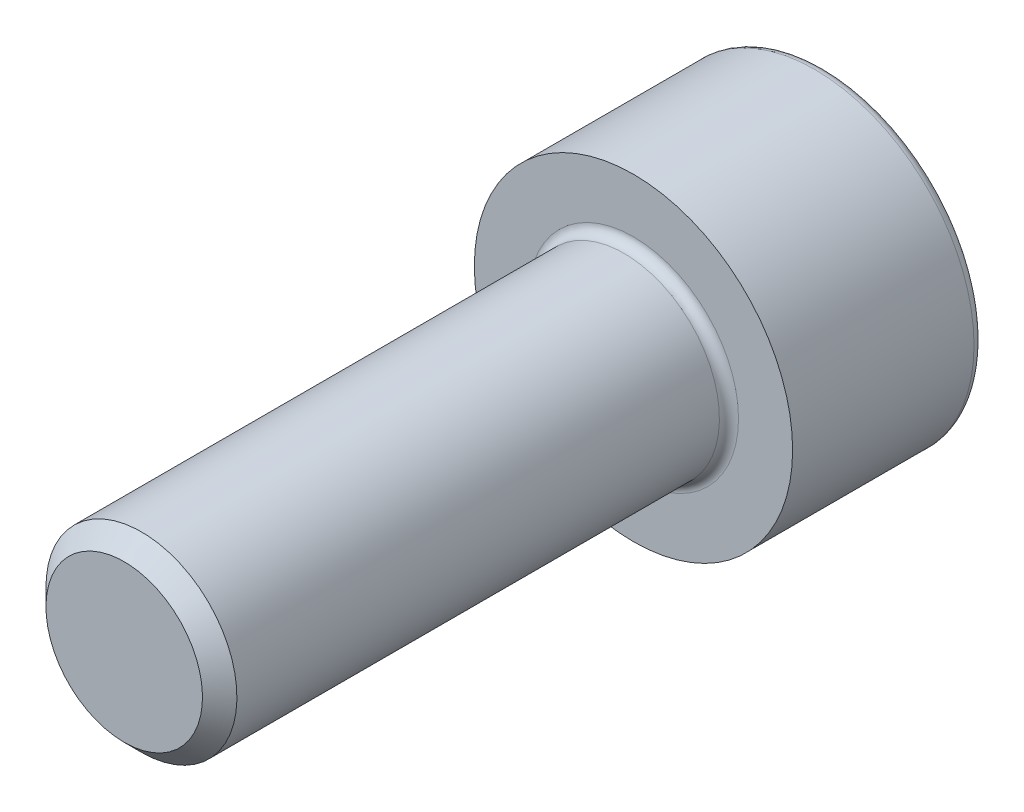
ISO-10303-21;
HEADER;
FILE_DESCRIPTION(('STEP AP214'),'2;1');
FILE_NAME('part.step','',(''),(''),'','','');
FILE_SCHEMA(('AUTOMOTIVE_DESIGN { 1 0 10303 214 1 1 1 1 }'));
ENDSEC;
DATA;
#1=APPLICATION_CONTEXT('core data for automotive mechanical design processes');
#2=APPLICATION_PROTOCOL_DEFINITION('international standard','automotive_design',2000,#1);
#3=PRODUCT_CONTEXT('',#1,'mechanical');
#4=PRODUCT('Part','Part','',(#3));
#5=PRODUCT_RELATED_PRODUCT_CATEGORY('part','',(#4));
#6=PRODUCT_DEFINITION_FORMATION('','',#4);
#7=PRODUCT_DEFINITION_CONTEXT('part definition',#1,'design');
#8=PRODUCT_DEFINITION('design','',#6,#7);
#9=PRODUCT_DEFINITION_SHAPE('','',#8);
#10=(LENGTH_UNIT() NAMED_UNIT(*) SI_UNIT(.MILLI.,.METRE.));
#11=(NAMED_UNIT(*) PLANE_ANGLE_UNIT() SI_UNIT($,.RADIAN.));
#12=(NAMED_UNIT(*) SI_UNIT($,.STERADIAN.) SOLID_ANGLE_UNIT());
#13=UNCERTAINTY_MEASURE_WITH_UNIT(LENGTH_MEASURE(1.E-05),#10,'distance_accuracy_value','');
#14=(GEOMETRIC_REPRESENTATION_CONTEXT(3) GLOBAL_UNCERTAINTY_ASSIGNED_CONTEXT((#13)) GLOBAL_UNIT_ASSIGNED_CONTEXT((#10,
#11,#12)) REPRESENTATION_CONTEXT('',''));
#15=CARTESIAN_POINT('',(0.,0.,0.));
#16=DIRECTION('',(0.,0.,1.));
#17=DIRECTION('',(1.,0.,0.));
#18=AXIS2_PLACEMENT_3D('',#15,#16,#17);
#19=CARTESIAN_POINT('',(0.,3.,16.));
#20=DIRECTION('',(0.,0.,1.));
#21=DIRECTION('',(0.,-1.,0.));
#22=AXIS2_PLACEMENT_3D('',#19,#20,#21);
#23=PLANE('',#22);
#24=CARTESIAN_POINT('',(0.,0.,16.));
#25=DIRECTION('',(0.,0.,1.));
#26=DIRECTION('',(0.,-1.,0.));
#27=AXIS2_PLACEMENT_3D('',#24,#25,#26);
#28=CIRCLE('',#27,2.45875);
#29=CARTESIAN_POINT('',(0.,-2.45875,16.));
#30=VERTEX_POINT('',#29);
#31=EDGE_CURVE('E11',#30,#30,#28,.T.);
#32=ORIENTED_EDGE('',*,*,#31,.T.);
#33=EDGE_LOOP('',(#32));
#34=FACE_BOUND('',#33,.T.);
#35=ADVANCED_FACE('F33',(#34),#23,.T.);
#36=CARTESIAN_POINT('',(0.,0.,-6.));
#37=DIRECTION('',(0.,0.,-1.));
#38=DIRECTION('',(0.,1.,0.));
#39=AXIS2_PLACEMENT_3D('',#36,#37,#38);
#40=CYLINDRICAL_SURFACE('',#39,3.);
#41=CARTESIAN_POINT('',(0.,0.,15.45875));
#42=DIRECTION('',(0.,0.,1.));
#43=DIRECTION('',(0.,-1.,0.));
#44=AXIS2_PLACEMENT_3D('',#41,#42,#43);
#45=CIRCLE('',#44,3.);
#46=CARTESIAN_POINT('',(0.,-3.,15.45875));
#47=VERTEX_POINT('',#46);
#48=EDGE_CURVE('E40',#47,#47,#45,.F.);
#49=ORIENTED_EDGE('',*,*,#48,.T.);
#50=EDGE_LOOP('',(#49));
#51=FACE_BOUND('',#50,.T.);
#52=CARTESIAN_POINT('',(0.,0.,0.300000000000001));
#53=DIRECTION('',(0.,0.,1.));
#54=DIRECTION('',(0.,-1.,0.));
#55=AXIS2_PLACEMENT_3D('',#52,#53,#54);
#56=CIRCLE('',#55,3.);
#57=CARTESIAN_POINT('',(0.,-3.,0.3));
#58=VERTEX_POINT('',#57);
#59=EDGE_CURVE('E183',#58,#58,#56,.T.);
#60=ORIENTED_EDGE('',*,*,#59,.T.);
#61=EDGE_LOOP('',(#60));
#62=FACE_BOUND('',#61,.T.);
#63=ADVANCED_FACE('F194',(#51,#62),#40,.T.);
#64=CARTESIAN_POINT('',(0.,5.,0.));
#65=DIRECTION('',(0.,0.,1.));
#66=DIRECTION('',(0.,-1.,0.));
#67=AXIS2_PLACEMENT_3D('',#64,#65,#66);
#68=PLANE('',#67);
#69=CARTESIAN_POINT('',(0.,0.,0.));
#70=DIRECTION('',(0.,0.,1.));
#71=DIRECTION('',(0.,-1.,0.));
#72=AXIS2_PLACEMENT_3D('',#69,#70,#71);
#73=CIRCLE('',#72,3.3);
#74=CARTESIAN_POINT('',(0.,-3.3,0.));
#75=VERTEX_POINT('',#74);
#76=EDGE_CURVE('E180',#75,#75,#73,.F.);
#77=ORIENTED_EDGE('',*,*,#76,.T.);
#78=EDGE_LOOP('',(#77));
#79=FACE_BOUND('',#78,.T.);
#80=CARTESIAN_POINT('',(0.,0.,0.));
#81=DIRECTION('',(0.,0.,-1.));
#82=DIRECTION('',(0.,1.,0.));
#83=AXIS2_PLACEMENT_3D('',#80,#81,#82);
#84=CIRCLE('',#83,5.);
#85=CARTESIAN_POINT('',(0.,5.,0.));
#86=VERTEX_POINT('',#85);
#87=EDGE_CURVE('E176',#86,#86,#84,.T.);
#88=ORIENTED_EDGE('',*,*,#87,.F.);
#89=EDGE_LOOP('',(#88));
#90=FACE_BOUND('',#89,.T.);
#91=ADVANCED_FACE('F214',(#79,#90),#68,.T.);
#92=CARTESIAN_POINT('',(0.,0.,-6.));
#93=DIRECTION('',(0.,0.,-1.));
#94=DIRECTION('',(0.,1.,0.));
#95=AXIS2_PLACEMENT_3D('',#92,#93,#94);
#96=CYLINDRICAL_SURFACE('',#95,5.);
#97=CARTESIAN_POINT('',(0.,0.,-5.7));
#98=DIRECTION('',(0.,0.,-1.));
#99=DIRECTION('',(0.,1.,0.));
#100=AXIS2_PLACEMENT_3D('',#97,#98,#99);
#101=CIRCLE('',#100,5.);
#102=CARTESIAN_POINT('',(0.,5.,-5.7));
#103=VERTEX_POINT('',#102);
#104=EDGE_CURVE('E189',#103,#103,#101,.F.);
#105=ORIENTED_EDGE('',*,*,#104,.T.);
#106=EDGE_LOOP('',(#105));
#107=FACE_BOUND('',#106,.T.);
#108=ORIENTED_EDGE('',*,*,#87,.T.);
#109=EDGE_LOOP('',(#108));
#110=FACE_BOUND('',#109,.T.);
#111=ADVANCED_FACE('F218',(#107,#110),#96,.T.);
#112=CARTESIAN_POINT('',(0.,0.,-6.));
#113=DIRECTION('',(0.,0.,-1.));
#114=DIRECTION('',(0.,1.,0.));
#115=AXIS2_PLACEMENT_3D('',#112,#113,#114);
#116=PLANE('',#115);
#117=CARTESIAN_POINT('',(0.,0.,-6.));
#118=DIRECTION('',(0.,0.,-1.));
#119=DIRECTION('',(0.,1.,0.));
#120=AXIS2_PLACEMENT_3D('',#117,#118,#119);
#121=CIRCLE('',#120,4.7);
#122=CARTESIAN_POINT('',(0.,4.7,-6.));
#123=VERTEX_POINT('',#122);
#124=EDGE_CURVE('E186',#123,#123,#121,.T.);
#125=ORIENTED_EDGE('',*,*,#124,.T.);
#126=EDGE_LOOP('',(#125));
#127=FACE_BOUND('',#126,.T.);
#128=DIRECTION('',(-1.,0.,0.));
#129=VECTOR('',#128,1.);
#130=CARTESIAN_POINT('',(1.44337567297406,-2.5,-6.));
#131=LINE('',#130,#129);
#132=CARTESIAN_POINT('',(1.44337567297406,-2.5,-6.));
#133=VERTEX_POINT('',#132);
#134=CARTESIAN_POINT('',(-1.44337567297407,-2.5,-6.));
#135=VERTEX_POINT('',#134);
#136=EDGE_CURVE('E137',#133,#135,#131,.T.);
#137=ORIENTED_EDGE('',*,*,#136,.F.);
#138=DIRECTION('',(-0.499999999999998,-0.86602540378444,0.));
#139=VECTOR('',#138,1.);
#140=CARTESIAN_POINT('',(2.88675134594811,0.,-6.));
#141=LINE('',#140,#139);
#142=CARTESIAN_POINT('',(2.88675134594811,0.,-6.));
#143=VERTEX_POINT('',#142);
#144=EDGE_CURVE('E132',#143,#133,#141,.T.);
#145=ORIENTED_EDGE('',*,*,#144,.F.);
#146=DIRECTION('',(0.499999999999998,-0.86602540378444,0.));
#147=VECTOR('',#146,1.);
#148=CARTESIAN_POINT('',(1.44337567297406,2.5,-6.));
#149=LINE('',#148,#147);
#150=CARTESIAN_POINT('',(1.44337567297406,2.5,-6.));
#151=VERTEX_POINT('',#150);
#152=EDGE_CURVE('E130',#151,#143,#149,.T.);
#153=ORIENTED_EDGE('',*,*,#152,.F.);
#154=DIRECTION('',(1.,0.,0.));
#155=VECTOR('',#154,1.);
#156=CARTESIAN_POINT('',(-1.44337567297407,2.5,-6.));
#157=LINE('',#156,#155);
#158=CARTESIAN_POINT('',(-1.44337567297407,2.5,-6.));
#159=VERTEX_POINT('',#158);
#160=EDGE_CURVE('E115',#159,#151,#157,.T.);
#161=ORIENTED_EDGE('',*,*,#160,.F.);
#162=DIRECTION('',(0.499999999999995,0.866025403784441,0.));
#163=VECTOR('',#162,1.);
#164=CARTESIAN_POINT('',(-2.88675134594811,0.,-6.));
#165=LINE('',#164,#163);
#166=CARTESIAN_POINT('',(-2.88675134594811,0.,-6.));
#167=VERTEX_POINT('',#166);
#168=EDGE_CURVE('E103',#167,#159,#165,.T.);
#169=ORIENTED_EDGE('',*,*,#168,.F.);
#170=DIRECTION('',(-0.499999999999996,0.866025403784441,0.));
#171=VECTOR('',#170,1.);
#172=CARTESIAN_POINT('',(-1.44337567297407,-2.5,-6.));
#173=LINE('',#172,#171);
#174=EDGE_CURVE('E140',#135,#167,#173,.T.);
#175=ORIENTED_EDGE('',*,*,#174,.F.);
#176=EDGE_LOOP('',(#137,#145,#153,#161,#169,#175));
#177=FACE_BOUND('',#176,.T.);
#178=ADVANCED_FACE('F128',(#127,#177),#116,.T.);
#179=CARTESIAN_POINT('',(-2.88675134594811,0.,-3.));
#180=DIRECTION('',(-0.866025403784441,0.499999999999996,0.));
#181=DIRECTION('',(-0.499999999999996,-0.866025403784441,0.));
#182=AXIS2_PLACEMENT_3D('',#179,#180,#181);
#183=PLANE('',#182);
#184=ORIENTED_EDGE('',*,*,#168,.T.);
#185=DIRECTION('',(0.,0.,-1.));
#186=VECTOR('',#185,1.);
#187=CARTESIAN_POINT('',(-1.44337567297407,2.5,-3.));
#188=LINE('',#187,#186);
#189=CARTESIAN_POINT('',(-1.44337567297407,2.5,-3.));
#190=VERTEX_POINT('',#189);
#191=EDGE_CURVE('E107',#190,#159,#188,.T.);
#192=ORIENTED_EDGE('',*,*,#191,.F.);
#193=DIRECTION('',(0.499999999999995,0.866025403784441,0.));
#194=VECTOR('',#193,1.);
#195=CARTESIAN_POINT('',(-2.88675134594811,0.,-3.));
#196=LINE('',#195,#194);
#197=CARTESIAN_POINT('',(-2.1650635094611,1.24999999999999,-3.));
#198=VERTEX_POINT('',#197);
#199=EDGE_CURVE('E142',#198,#190,#196,.T.);
#200=ORIENTED_EDGE('',*,*,#199,.F.);
#201=CARTESIAN_POINT('',(-2.88675134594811,0.,-3.));
#202=VERTEX_POINT('',#201);
#203=EDGE_CURVE('E143',#202,#198,#196,.T.);
#204=ORIENTED_EDGE('',*,*,#203,.F.);
#205=DIRECTION('',(0.,0.,-1.));
#206=VECTOR('',#205,1.);
#207=CARTESIAN_POINT('',(-2.88675134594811,0.,-3.));
#208=LINE('',#207,#206);
#209=EDGE_CURVE('E111',#202,#167,#208,.T.);
#210=ORIENTED_EDGE('',*,*,#209,.T.);
#211=EDGE_LOOP('',(#184,#192,#200,#204,#210));
#212=FACE_BOUND('',#211,.T.);
#213=ADVANCED_FACE('F105',(#212),#183,.F.);
#214=CARTESIAN_POINT('',(-1.44337567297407,-2.5,-3.));
#215=DIRECTION('',(-0.866025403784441,-0.499999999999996,0.));
#216=DIRECTION('',(0.499999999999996,-0.866025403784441,0.));
#217=AXIS2_PLACEMENT_3D('',#214,#215,#216);
#218=PLANE('',#217);
#219=ORIENTED_EDGE('',*,*,#174,.T.);
#220=ORIENTED_EDGE('',*,*,#209,.F.);
#221=DIRECTION('',(-0.499999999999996,0.866025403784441,0.));
#222=VECTOR('',#221,1.);
#223=CARTESIAN_POINT('',(-1.44337567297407,-2.5,-3.));
#224=LINE('',#223,#222);
#225=CARTESIAN_POINT('',(-2.1650635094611,-1.24999999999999,-3.));
#226=VERTEX_POINT('',#225);
#227=EDGE_CURVE('E158',#226,#202,#224,.T.);
#228=ORIENTED_EDGE('',*,*,#227,.F.);
#229=CARTESIAN_POINT('',(-1.44337567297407,-2.5,-3.));
#230=VERTEX_POINT('',#229);
#231=EDGE_CURVE('E126',#230,#226,#224,.T.);
#232=ORIENTED_EDGE('',*,*,#231,.F.);
#233=DIRECTION('',(0.,0.,-1.));
#234=VECTOR('',#233,1.);
#235=CARTESIAN_POINT('',(-1.44337567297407,-2.5,-3.));
#236=LINE('',#235,#234);
#237=EDGE_CURVE('E163',#230,#135,#236,.T.);
#238=ORIENTED_EDGE('',*,*,#237,.T.);
#239=EDGE_LOOP('',(#219,#220,#228,#232,#238));
#240=FACE_BOUND('',#239,.T.);
#241=ADVANCED_FACE('F234',(#240),#218,.F.);
#242=CARTESIAN_POINT('',(1.44337567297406,-2.5,-3.));
#243=DIRECTION('',(0.,-1.,0.));
#244=DIRECTION('',(0.,0.,-1.));
#245=AXIS2_PLACEMENT_3D('',#242,#243,#244);
#246=PLANE('',#245);
#247=ORIENTED_EDGE('',*,*,#136,.T.);
#248=ORIENTED_EDGE('',*,*,#237,.F.);
#249=DIRECTION('',(-1.,0.,0.));
#250=VECTOR('',#249,1.);
#251=CARTESIAN_POINT('',(1.44337567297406,-2.5,-3.));
#252=LINE('',#251,#250);
#253=CARTESIAN_POINT('',(0.,-2.5,-3.));
#254=VERTEX_POINT('',#253);
#255=EDGE_CURVE('E154',#254,#230,#252,.T.);
#256=ORIENTED_EDGE('',*,*,#255,.F.);
#257=CARTESIAN_POINT('',(1.44337567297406,-2.5,-3.));
#258=VERTEX_POINT('',#257);
#259=EDGE_CURVE('E155',#258,#254,#252,.T.);
#260=ORIENTED_EDGE('',*,*,#259,.F.);
#261=DIRECTION('',(0.,0.,-1.));
#262=VECTOR('',#261,1.);
#263=CARTESIAN_POINT('',(1.44337567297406,-2.5,-3.));
#264=LINE('',#263,#262);
#265=EDGE_CURVE('E166',#258,#133,#264,.T.);
#266=ORIENTED_EDGE('',*,*,#265,.T.);
#267=EDGE_LOOP('',(#247,#248,#256,#260,#266));
#268=FACE_BOUND('',#267,.T.);
#269=ADVANCED_FACE('F245',(#268),#246,.F.);
#270=CARTESIAN_POINT('',(2.88675134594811,0.,-3.));
#271=DIRECTION('',(0.86602540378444,-0.499999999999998,0.));
#272=DIRECTION('',(0.499999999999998,0.86602540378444,0.));
#273=AXIS2_PLACEMENT_3D('',#270,#271,#272);
#274=PLANE('',#273);
#275=ORIENTED_EDGE('',*,*,#144,.T.);
#276=ORIENTED_EDGE('',*,*,#265,.F.);
#277=DIRECTION('',(-0.499999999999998,-0.86602540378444,0.));
#278=VECTOR('',#277,1.);
#279=CARTESIAN_POINT('',(2.88675134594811,0.,-3.));
#280=LINE('',#279,#278);
#281=CARTESIAN_POINT('',(2.16506350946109,-1.24999999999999,-3.));
#282=VERTEX_POINT('',#281);
#283=EDGE_CURVE('E150',#282,#258,#280,.T.);
#284=ORIENTED_EDGE('',*,*,#283,.F.);
#285=CARTESIAN_POINT('',(2.88675134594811,0.,-3.));
#286=VERTEX_POINT('',#285);
#287=EDGE_CURVE('E151',#286,#282,#280,.T.);
#288=ORIENTED_EDGE('',*,*,#287,.F.);
#289=DIRECTION('',(0.,0.,-1.));
#290=VECTOR('',#289,1.);
#291=CARTESIAN_POINT('',(2.88675134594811,0.,-3.));
#292=LINE('',#291,#290);
#293=EDGE_CURVE('E169',#286,#143,#292,.T.);
#294=ORIENTED_EDGE('',*,*,#293,.T.);
#295=EDGE_LOOP('',(#275,#276,#284,#288,#294));
#296=FACE_BOUND('',#295,.T.);
#297=ADVANCED_FACE('F241',(#296),#274,.F.);
#298=CARTESIAN_POINT('',(1.44337567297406,2.5,-3.));
#299=DIRECTION('',(0.86602540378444,0.499999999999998,0.));
#300=DIRECTION('',(-0.499999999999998,0.86602540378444,0.));
#301=AXIS2_PLACEMENT_3D('',#298,#299,#300);
#302=PLANE('',#301);
#303=ORIENTED_EDGE('',*,*,#152,.T.);
#304=ORIENTED_EDGE('',*,*,#293,.F.);
#305=DIRECTION('',(0.499999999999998,-0.86602540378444,0.));
#306=VECTOR('',#305,1.);
#307=CARTESIAN_POINT('',(1.44337567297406,2.5,-3.));
#308=LINE('',#307,#306);
#309=CARTESIAN_POINT('',(2.1650635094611,1.24999999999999,-3.));
#310=VERTEX_POINT('',#309);
#311=EDGE_CURVE('E148',#310,#286,#308,.T.);
#312=ORIENTED_EDGE('',*,*,#311,.F.);
#313=CARTESIAN_POINT('',(1.44337567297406,2.5,-3.));
#314=VERTEX_POINT('',#313);
#315=EDGE_CURVE('E47',#314,#310,#308,.T.);
#316=ORIENTED_EDGE('',*,*,#315,.F.);
#317=DIRECTION('',(0.,0.,-1.));
#318=VECTOR('',#317,1.);
#319=CARTESIAN_POINT('',(1.44337567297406,2.5,-3.));
#320=LINE('',#319,#318);
#321=EDGE_CURVE('E125',#314,#151,#320,.T.);
#322=ORIENTED_EDGE('',*,*,#321,.T.);
#323=EDGE_LOOP('',(#303,#304,#312,#316,#322));
#324=FACE_BOUND('',#323,.T.);
#325=ADVANCED_FACE('F238',(#324),#302,.F.);
#326=CARTESIAN_POINT('',(-1.44337567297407,2.5,-3.));
#327=DIRECTION('',(0.,1.,0.));
#328=DIRECTION('',(0.,0.,1.));
#329=AXIS2_PLACEMENT_3D('',#326,#327,#328);
#330=PLANE('',#329);
#331=ORIENTED_EDGE('',*,*,#160,.T.);
#332=ORIENTED_EDGE('',*,*,#321,.F.);
#333=DIRECTION('',(1.,0.,0.));
#334=VECTOR('',#333,1.);
#335=CARTESIAN_POINT('',(-1.44337567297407,2.5,-3.));
#336=LINE('',#335,#334);
#337=CARTESIAN_POINT('',(0.,2.5,-3.));
#338=VERTEX_POINT('',#337);
#339=EDGE_CURVE('E146',#338,#314,#336,.T.);
#340=ORIENTED_EDGE('',*,*,#339,.F.);
#341=EDGE_CURVE('E124',#190,#338,#336,.T.);
#342=ORIENTED_EDGE('',*,*,#341,.F.);
#343=ORIENTED_EDGE('',*,*,#191,.T.);
#344=EDGE_LOOP('',(#331,#332,#340,#342,#343));
#345=FACE_BOUND('',#344,.T.);
#346=ADVANCED_FACE('F119',(#345),#330,.F.);
#347=CARTESIAN_POINT('',(-1.44337567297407,2.5,-3.));
#348=DIRECTION('',(0.,0.,-1.));
#349=DIRECTION('',(0.,1.,0.));
#350=AXIS2_PLACEMENT_3D('',#347,#348,#349);
#351=PLANE('',#350);
#352=CARTESIAN_POINT('',(0.,0.,-3.));
#353=DIRECTION('',(0.,0.,-1.));
#354=DIRECTION('',(0.,1.,0.));
#355=AXIS2_PLACEMENT_3D('',#352,#353,#354);
#356=CIRCLE('',#355,2.5);
#357=EDGE_CURVE('E162',#198,#338,#356,.T.);
#358=ORIENTED_EDGE('',*,*,#357,.F.);
#359=ORIENTED_EDGE('',*,*,#199,.T.);
#360=ORIENTED_EDGE('',*,*,#341,.T.);
#361=EDGE_LOOP('',(#358,#359,#360));
#362=FACE_BOUND('',#361,.T.);
#363=ADVANCED_FACE('F237',(#362),#351,.T.);
#364=EDGE_CURVE('E402',#226,#198,#356,.T.);
#365=ORIENTED_EDGE('',*,*,#364,.F.);
#366=ORIENTED_EDGE('',*,*,#227,.T.);
#367=ORIENTED_EDGE('',*,*,#203,.T.);
#368=EDGE_LOOP('',(#365,#366,#367));
#369=FACE_BOUND('',#368,.T.);
#370=ADVANCED_FACE('F255',(#369),#351,.T.);
#371=EDGE_CURVE('E403',#254,#226,#356,.T.);
#372=ORIENTED_EDGE('',*,*,#371,.F.);
#373=ORIENTED_EDGE('',*,*,#255,.T.);
#374=ORIENTED_EDGE('',*,*,#231,.T.);
#375=EDGE_LOOP('',(#372,#373,#374));
#376=FACE_BOUND('',#375,.T.);
#377=ADVANCED_FACE('F351',(#376),#351,.T.);
#378=EDGE_CURVE('E404',#282,#254,#356,.T.);
#379=ORIENTED_EDGE('',*,*,#378,.F.);
#380=ORIENTED_EDGE('',*,*,#283,.T.);
#381=ORIENTED_EDGE('',*,*,#259,.T.);
#382=EDGE_LOOP('',(#379,#380,#381));
#383=FACE_BOUND('',#382,.T.);
#384=ADVANCED_FACE('F359',(#383),#351,.T.);
#385=EDGE_CURVE('E177',#310,#282,#356,.T.);
#386=ORIENTED_EDGE('',*,*,#385,.F.);
#387=ORIENTED_EDGE('',*,*,#311,.T.);
#388=ORIENTED_EDGE('',*,*,#287,.T.);
#389=EDGE_LOOP('',(#386,#387,#388));
#390=FACE_BOUND('',#389,.T.);
#391=ADVANCED_FACE('F367',(#390),#351,.T.);
#392=EDGE_CURVE('E173',#338,#310,#356,.T.);
#393=ORIENTED_EDGE('',*,*,#392,.F.);
#394=ORIENTED_EDGE('',*,*,#339,.T.);
#395=ORIENTED_EDGE('',*,*,#315,.T.);
#396=EDGE_LOOP('',(#393,#394,#395));
#397=FACE_BOUND('',#396,.T.);
#398=ADVANCED_FACE('F231',(#397),#351,.T.);
#399=CARTESIAN_POINT('',(0.,0.,-3.));
#400=DIRECTION('',(0.,0.,-1.));
#401=DIRECTION('',(0.,1.,0.));
#402=AXIS2_PLACEMENT_3D('',#399,#400,#401);
#403=CONICAL_SURFACE('',#402,2.5,1.0471975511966);
#404=CARTESIAN_POINT('',(0.,0.,-1.55662432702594));
#405=VERTEX_POINT('',#404);
#406=VERTEX_LOOP('',#405);
#407=FACE_BOUND('',#406,.T.);
#408=ORIENTED_EDGE('',*,*,#392,.T.);
#409=ORIENTED_EDGE('',*,*,#385,.T.);
#410=ORIENTED_EDGE('',*,*,#378,.T.);
#411=ORIENTED_EDGE('',*,*,#371,.T.);
#412=ORIENTED_EDGE('',*,*,#364,.T.);
#413=ORIENTED_EDGE('',*,*,#357,.T.);
#414=EDGE_LOOP('',(#408,#409,#410,#411,#412,#413));
#415=FACE_BOUND('',#414,.T.);
#416=ADVANCED_FACE('F228',(#407,#415),#403,.F.);
#417=CARTESIAN_POINT('',(0.,0.,0.3));
#418=DIRECTION('',(0.,0.,1.));
#419=DIRECTION('',(0.,-1.,0.));
#420=AXIS2_PLACEMENT_3D('',#417,#418,#419);
#421=TOROIDAL_SURFACE('',#420,3.3,0.3);
#422=ORIENTED_EDGE('',*,*,#59,.F.);
#423=EDGE_LOOP('',(#422));
#424=FACE_BOUND('',#423,.T.);
#425=ORIENTED_EDGE('',*,*,#76,.F.);
#426=EDGE_LOOP('',(#425));
#427=FACE_BOUND('',#426,.T.);
#428=ADVANCED_FACE('F205',(#424,#427),#421,.F.);
#429=CARTESIAN_POINT('',(0.,0.,-5.7));
#430=DIRECTION('',(0.,0.,-1.));
#431=DIRECTION('',(0.,1.,0.));
#432=AXIS2_PLACEMENT_3D('',#429,#430,#431);
#433=TOROIDAL_SURFACE('',#432,4.7,0.3);
#434=ORIENTED_EDGE('',*,*,#104,.F.);
#435=EDGE_LOOP('',(#434));
#436=FACE_BOUND('',#435,.T.);
#437=ORIENTED_EDGE('',*,*,#124,.F.);
#438=EDGE_LOOP('',(#437));
#439=FACE_BOUND('',#438,.T.);
#440=ADVANCED_FACE('F199',(#436,#439),#433,.T.);
#441=CARTESIAN_POINT('',(0.,0.,15.45875));
#442=DIRECTION('',(0.,0.,-1.));
#443=DIRECTION('',(0.,1.,0.));
#444=AXIS2_PLACEMENT_3D('',#441,#442,#443);
#445=CONICAL_SURFACE('',#444,3.,0.785398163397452);
#446=ORIENTED_EDGE('',*,*,#31,.F.);
#447=EDGE_LOOP('',(#446));
#448=FACE_BOUND('',#447,.T.);
#449=ORIENTED_EDGE('',*,*,#48,.F.);
#450=EDGE_LOOP('',(#449));
#451=FACE_BOUND('',#450,.T.);
#452=ADVANCED_FACE('F197',(#448,#451),#445,.T.);
#453=CLOSED_SHELL('',(#35,#63,#91,#111,#178,#213,#241,#269,#297,#325,#346,#363,#370,#377,#384,
#391,#398,#416,#428,#440,#452));
#454=MANIFOLD_SOLID_BREP('B2',#453);
#455=ADVANCED_BREP_SHAPE_REPRESENTATION('',(#18,#454),#14);
#456=SHAPE_DEFINITION_REPRESENTATION(#9,#455);
ENDSEC;
END-ISO-10303-21;
